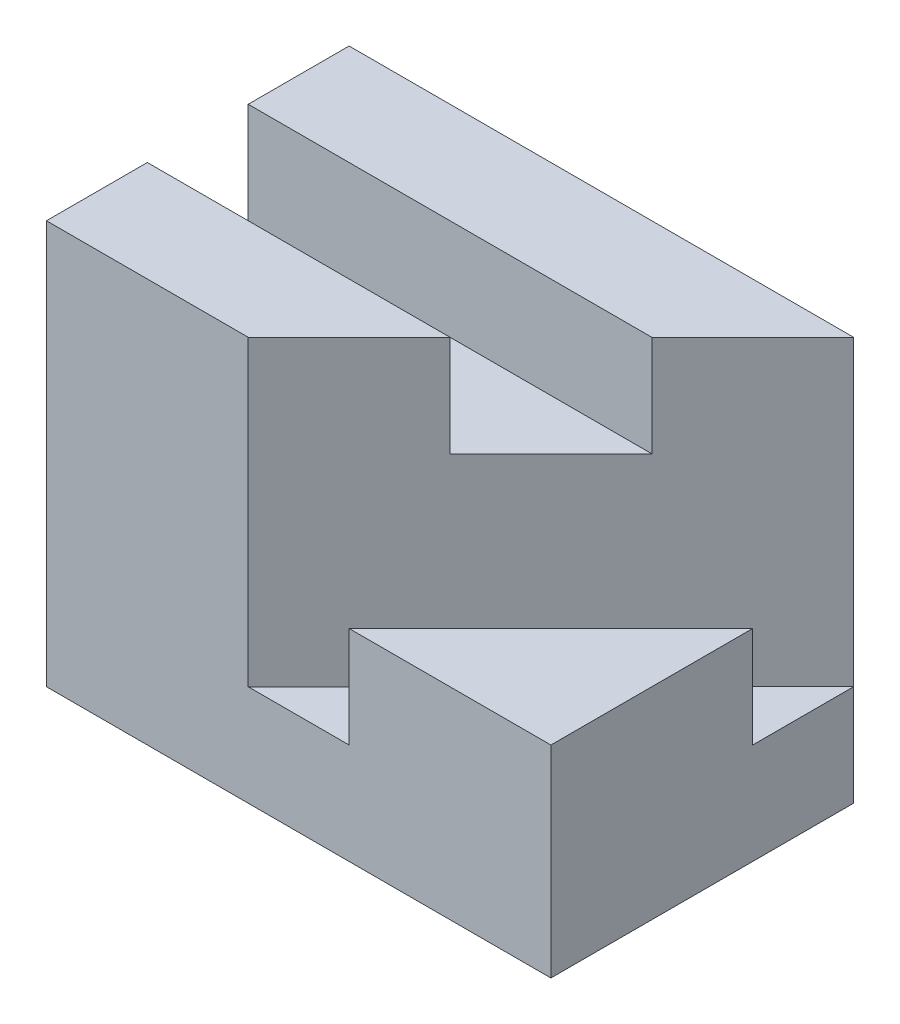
from build123d import *

# Parameters (mm, degrees)
SKETCH1_W      = 50
SKETCH1_H      = 30
EXTRUDE1_DEPTH = 40
EXTRUDE2_DEPTH = 10
EXTRUDE3_DEPTH = 30
EXTRUDE4_DEPTH = 20


with BuildPart() as part:
    # Sketch1 → Extrude1 (new body)
    with BuildSketch(Plane(origin=(0, 0, 0), x_dir=(1, 0, 0), z_dir=(0, 1, 0))):
        Rectangle(SKETCH1_W, SKETCH1_H)
    extrude(amount=EXTRUDE1_DEPTH)

    # Sketch2 → Extrude2 (cut)
    with BuildSketch(Plane(origin=(0, 40, 0), x_dir=(1, 0, 0), z_dir=(0, 1, 0))):
        Polygon((5, -5), (15, 5), (-25, 5), (-25, -5), align=None)
    extrude(amount=-EXTRUDE2_DEPTH, mode=Mode.SUBTRACT)

    # Sketch → Extrude3 (cut)
    with BuildSketch(Plane(origin=(0, 40, 0), x_dir=(1, 0, 0), z_dir=(0, 1, 0))):
        Polygon((25, 5), (25, 15), (15, 5), (5, -5), (-5, -15), (5, -15), align=None)
    extrude(amount=-EXTRUDE3_DEPTH, mode=Mode.SUBTRACT)

    # Sketch 2 → Extrude4 (cut)
    with BuildSketch(Plane(origin=(0, 40, 0), x_dir=(1, 0, 0), z_dir=(0, 1, 0))):
        Polygon((25, -15), (25, 5), (5, -15), align=None)
    extrude(amount=-EXTRUDE4_DEPTH, mode=Mode.SUBTRACT)


solid = part.part
